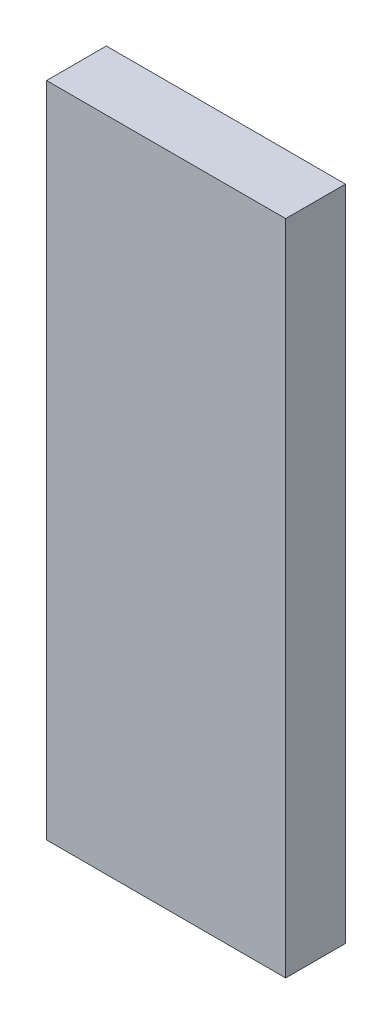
from build123d import *

# Parameters (mm, degrees)
ESQUISSE2_W        = 20
ESQUISSE2_H        = 55
BOSS_EXTRU_1_DEPTH = 5


with BuildPart() as part:
    # Esquisse2 → Boss.-Extru.1 (new body)
    with BuildSketch(Plane.XY):
        Rectangle(ESQUISSE2_W, ESQUISSE2_H)
    extrude(amount=BOSS_EXTRU_1_DEPTH)


solid = part.part
